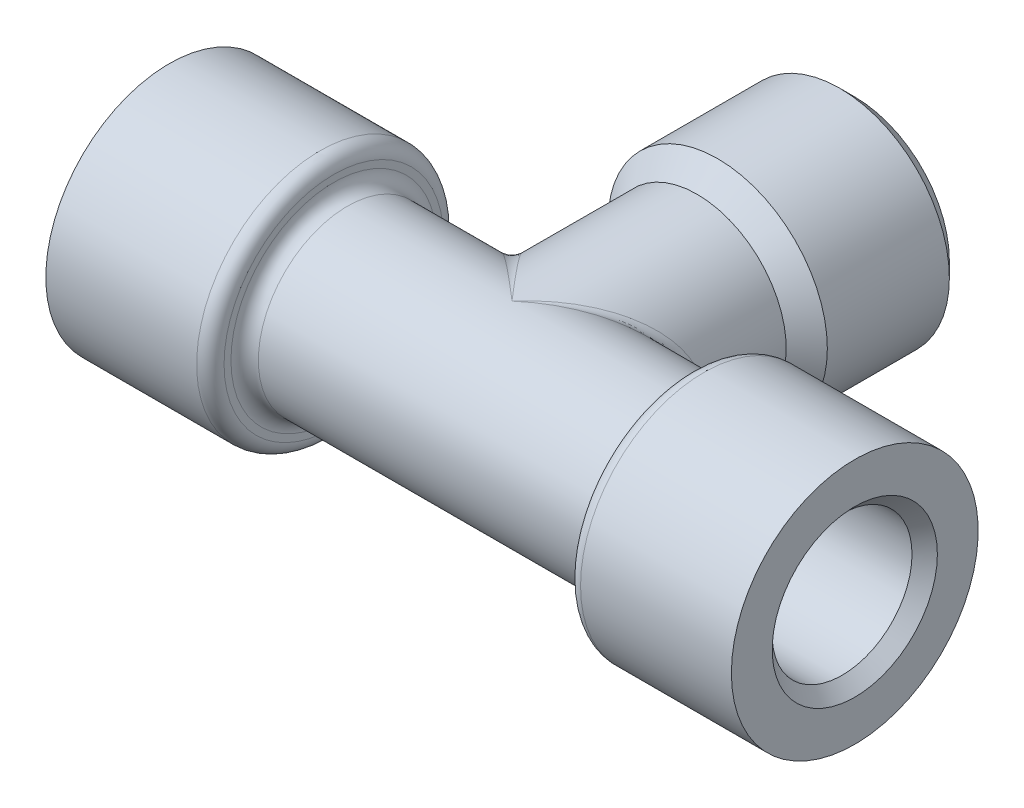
ISO-10303-21;
HEADER;
FILE_DESCRIPTION(('STEP AP214'),'2;1');
FILE_NAME('part.step','',(''),(''),'','','');
FILE_SCHEMA(('AUTOMOTIVE_DESIGN { 1 0 10303 214 1 1 1 1 }'));
ENDSEC;
DATA;
#1=APPLICATION_CONTEXT('core data for automotive mechanical design processes');
#2=APPLICATION_PROTOCOL_DEFINITION('international standard','automotive_design',2000,#1);
#3=PRODUCT_CONTEXT('',#1,'mechanical');
#4=PRODUCT('Part','Part','',(#3));
#5=PRODUCT_RELATED_PRODUCT_CATEGORY('part','',(#4));
#6=PRODUCT_DEFINITION_FORMATION('','',#4);
#7=PRODUCT_DEFINITION_CONTEXT('part definition',#1,'design');
#8=PRODUCT_DEFINITION('design','',#6,#7);
#9=PRODUCT_DEFINITION_SHAPE('','',#8);
#10=(LENGTH_UNIT() NAMED_UNIT(*) SI_UNIT(.MILLI.,.METRE.));
#11=(NAMED_UNIT(*) PLANE_ANGLE_UNIT() SI_UNIT($,.RADIAN.));
#12=(NAMED_UNIT(*) SI_UNIT($,.STERADIAN.) SOLID_ANGLE_UNIT());
#13=UNCERTAINTY_MEASURE_WITH_UNIT(LENGTH_MEASURE(1.E-05),#10,'distance_accuracy_value','');
#14=(GEOMETRIC_REPRESENTATION_CONTEXT(3) GLOBAL_UNCERTAINTY_ASSIGNED_CONTEXT((#13)) GLOBAL_UNIT_ASSIGNED_CONTEXT((#10,
#11,#12)) REPRESENTATION_CONTEXT('',''));
#15=CARTESIAN_POINT('',(0.,0.,0.));
#16=DIRECTION('',(0.,0.,1.));
#17=DIRECTION('',(1.,0.,0.));
#18=AXIS2_PLACEMENT_3D('',#15,#16,#17);
#19=CARTESIAN_POINT('',(0.,9.,-25.));
#20=DIRECTION('',(0.,0.,-1.));
#21=DIRECTION('',(-1.,0.,0.));
#22=AXIS2_PLACEMENT_3D('',#19,#20,#21);
#23=PLANE('',#22);
#24=CARTESIAN_POINT('',(0.,0.,-25.));
#25=DIRECTION('',(0.,0.,-1.));
#26=DIRECTION('',(-1.,0.,0.));
#27=AXIS2_PLACEMENT_3D('',#24,#25,#26);
#28=CIRCLE('',#27,4.);
#29=CARTESIAN_POINT('',(-3.99999999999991,0.,-25.));
#30=VERTEX_POINT('',#29);
#31=EDGE_CURVE('E75',#30,#30,#28,.T.);
#32=ORIENTED_EDGE('',*,*,#31,.F.);
#33=EDGE_LOOP('',(#32));
#34=FACE_BOUND('',#33,.T.);
#35=CARTESIAN_POINT('',(0.,0.,-25.));
#36=DIRECTION('',(0.,0.,1.));
#37=DIRECTION('',(1.,0.,0.));
#38=AXIS2_PLACEMENT_3D('',#35,#36,#37);
#39=CIRCLE('',#38,6.8985);
#40=CARTESIAN_POINT('',(6.89850000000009,0.,-25.));
#41=VERTEX_POINT('',#40);
#42=EDGE_CURVE('E175',#41,#41,#39,.T.);
#43=ORIENTED_EDGE('',*,*,#42,.F.);
#44=EDGE_LOOP('',(#43));
#45=FACE_BOUND('',#44,.T.);
#46=ADVANCED_FACE('F42',(#34,#45),#23,.T.);
#47=CARTESIAN_POINT('',(0.,0.,0.));
#48=DIRECTION('',(1.,0.,0.));
#49=DIRECTION('',(0.,0.,-1.));
#50=AXIS2_PLACEMENT_3D('',#47,#48,#49);
#51=CYLINDRICAL_SURFACE('',#50,6.5);
#52=CARTESIAN_POINT('',(12.,0.,0.));
#53=DIRECTION('',(-1.,0.,0.));
#54=DIRECTION('',(0.,0.,1.));
#55=AXIS2_PLACEMENT_3D('',#52,#53,#54);
#56=CIRCLE('',#55,6.5);
#57=CARTESIAN_POINT('',(12.,0.,6.5));
#58=VERTEX_POINT('',#57);
#59=EDGE_CURVE('E115',#58,#58,#56,.T.);
#60=ORIENTED_EDGE('',*,*,#59,.T.);
#61=EDGE_LOOP('',(#60));
#62=FACE_BOUND('',#61,.T.);
#63=CARTESIAN_POINT('',(-12.,0.,0.));
#64=DIRECTION('',(1.,0.,0.));
#65=DIRECTION('',(0.,0.,-1.));
#66=AXIS2_PLACEMENT_3D('',#63,#64,#65);
#67=CIRCLE('',#66,6.5);
#68=CARTESIAN_POINT('',(-12.,0.,-6.5));
#69=VERTEX_POINT('',#68);
#70=EDGE_CURVE('E112',#69,#69,#67,.T.);
#71=ORIENTED_EDGE('',*,*,#70,.T.);
#72=EDGE_LOOP('',(#71));
#73=FACE_BOUND('',#72,.T.);
#74=CARTESIAN_POINT('',(0.,0.,0.));
#75=DIRECTION('',(0.654930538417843,0.,-0.755689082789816));
#76=DIRECTION('',(0.755689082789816,0.,0.654930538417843));
#77=AXIS2_PLACEMENT_3D('',#74,#75,#76);
#78=ELLIPSE('',#77,9.92471662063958,6.5);
#79=CARTESIAN_POINT('',(0.,6.5,0.));
#80=VERTEX_POINT('',#79);
#81=CARTESIAN_POINT('',(0.,-6.5,0.));
#82=VERTEX_POINT('',#81);
#83=EDGE_CURVE('E107',#80,#82,#78,.F.);
#84=ORIENTED_EDGE('',*,*,#83,.T.);
#85=CARTESIAN_POINT('',(0.,0.,0.));
#86=DIRECTION('',(-0.654930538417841,0.,-0.755689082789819));
#87=DIRECTION('',(0.755689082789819,0.,-0.654930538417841));
#88=AXIS2_PLACEMENT_3D('',#85,#86,#87);
#89=ELLIPSE('',#88,9.92471662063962,6.5);
#90=EDGE_CURVE('E109',#82,#80,#89,.F.);
#91=ORIENTED_EDGE('',*,*,#90,.T.);
#92=EDGE_LOOP('',(#84,#91));
#93=FACE_BOUND('',#92,.T.);
#94=ADVANCED_FACE('F139',(#62,#73,#93),#51,.T.);
#95=CARTESIAN_POINT('',(-13.,6.5,0.));
#96=DIRECTION('',(1.,0.,0.));
#97=DIRECTION('',(0.,0.,-1.));
#98=AXIS2_PLACEMENT_3D('',#95,#96,#97);
#99=PLANE('',#98);
#100=CARTESIAN_POINT('',(-13.,0.,0.));
#101=DIRECTION('',(1.,0.,0.));
#102=DIRECTION('',(0.,0.,-1.));
#103=AXIS2_PLACEMENT_3D('',#100,#101,#102);
#104=CIRCLE('',#103,8.);
#105=CARTESIAN_POINT('',(-13.,0.,-8.));
#106=VERTEX_POINT('',#105);
#107=EDGE_CURVE('E92',#106,#106,#104,.T.);
#108=ORIENTED_EDGE('',*,*,#107,.T.);
#109=EDGE_LOOP('',(#108));
#110=FACE_BOUND('',#109,.T.);
#111=CARTESIAN_POINT('',(-13.,0.,0.));
#112=DIRECTION('',(1.,0.,0.));
#113=DIRECTION('',(0.,0.,-1.));
#114=AXIS2_PLACEMENT_3D('',#111,#112,#113);
#115=CIRCLE('',#114,7.5);
#116=CARTESIAN_POINT('',(-13.,0.,-7.5));
#117=VERTEX_POINT('',#116);
#118=EDGE_CURVE('E89',#117,#117,#115,.F.);
#119=ORIENTED_EDGE('',*,*,#118,.T.);
#120=EDGE_LOOP('',(#119));
#121=FACE_BOUND('',#120,.T.);
#122=ADVANCED_FACE('F158',(#110,#121),#99,.T.);
#123=CARTESIAN_POINT('',(0.,0.,0.));
#124=DIRECTION('',(1.,0.,0.));
#125=DIRECTION('',(0.,0.,-1.));
#126=AXIS2_PLACEMENT_3D('',#123,#124,#125);
#127=CYLINDRICAL_SURFACE('',#126,9.);
#128=CARTESIAN_POINT('',(-14.,0.,0.));
#129=DIRECTION('',(1.,0.,0.));
#130=DIRECTION('',(0.,0.,-1.));
#131=AXIS2_PLACEMENT_3D('',#128,#129,#130);
#132=CIRCLE('',#131,9.);
#133=CARTESIAN_POINT('',(-14.,0.,-9.));
#134=VERTEX_POINT('',#133);
#135=EDGE_CURVE('E95',#134,#134,#132,.F.);
#136=ORIENTED_EDGE('',*,*,#135,.T.);
#137=EDGE_LOOP('',(#136));
#138=FACE_BOUND('',#137,.T.);
#139=CARTESIAN_POINT('',(-25.,0.,0.));
#140=DIRECTION('',(1.,0.,0.));
#141=DIRECTION('',(0.,0.,-1.));
#142=AXIS2_PLACEMENT_3D('',#139,#140,#141);
#143=CIRCLE('',#142,9.);
#144=CARTESIAN_POINT('',(-25.,0.,-9.));
#145=VERTEX_POINT('',#144);
#146=EDGE_CURVE('E86',#145,#145,#143,.T.);
#147=ORIENTED_EDGE('',*,*,#146,.T.);
#148=EDGE_LOOP('',(#147));
#149=FACE_BOUND('',#148,.T.);
#150=ADVANCED_FACE('F155',(#138,#149),#127,.T.);
#151=CARTESIAN_POINT('',(-25.,9.,0.));
#152=DIRECTION('',(-1.,0.,0.));
#153=DIRECTION('',(0.,0.,1.));
#154=AXIS2_PLACEMENT_3D('',#151,#152,#153);
#155=PLANE('',#154);
#156=CARTESIAN_POINT('',(-25.,0.,0.));
#157=DIRECTION('',(-1.,0.,0.));
#158=DIRECTION('',(0.,0.,1.));
#159=AXIS2_PLACEMENT_3D('',#156,#157,#158);
#160=CIRCLE('',#159,6.025);
#161=CARTESIAN_POINT('',(-25.,0.,6.025));
#162=VERTEX_POINT('',#161);
#163=EDGE_CURVE('E181',#162,#162,#160,.T.);
#164=ORIENTED_EDGE('',*,*,#163,.F.);
#165=EDGE_LOOP('',(#164));
#166=FACE_BOUND('',#165,.T.);
#167=ORIENTED_EDGE('',*,*,#146,.F.);
#168=EDGE_LOOP('',(#167));
#169=FACE_BOUND('',#168,.T.);
#170=ADVANCED_FACE('F149',(#166,#169),#155,.T.);
#171=CARTESIAN_POINT('',(0.,0.,0.));
#172=DIRECTION('',(0.,0.,1.));
#173=DIRECTION('',(1.,0.,0.));
#174=AXIS2_PLACEMENT_3D('',#171,#172,#173);
#175=CYLINDRICAL_SURFACE('',#174,6.5);
#176=CARTESIAN_POINT('',(0.,0.,-13.5));
#177=DIRECTION('',(0.,0.,-1.));
#178=DIRECTION('',(-1.,0.,0.));
#179=AXIS2_PLACEMENT_3D('',#176,#177,#178);
#180=CIRCLE('',#179,6.5);
#181=CARTESIAN_POINT('',(-6.49999999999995,0.,-13.5000000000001));
#182=VERTEX_POINT('',#181);
#183=EDGE_CURVE('E11',#182,#182,#180,.F.);
#184=ORIENTED_EDGE('',*,*,#183,.T.);
#185=EDGE_LOOP('',(#184));
#186=FACE_BOUND('',#185,.T.);
#187=CARTESIAN_POINT('',(0.,0.,0.));
#188=DIRECTION('',(0.755689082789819,0.,-0.654930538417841));
#189=DIRECTION('',(0.654930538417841,0.,0.755689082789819));
#190=AXIS2_PLACEMENT_3D('',#187,#188,#189);
#191=ELLIPSE('',#190,9.92471662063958,6.5);
#192=EDGE_CURVE('E118',#82,#80,#191,.T.);
#193=ORIENTED_EDGE('',*,*,#192,.T.);
#194=CARTESIAN_POINT('',(0.,0.,0.));
#195=DIRECTION('',(-0.755689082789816,0.,-0.654930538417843));
#196=DIRECTION('',(0.654930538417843,0.,-0.755689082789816));
#197=AXIS2_PLACEMENT_3D('',#194,#195,#196);
#198=ELLIPSE('',#197,9.92471662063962,6.5);
#199=EDGE_CURVE('E51',#80,#82,#198,.T.);
#200=ORIENTED_EDGE('',*,*,#199,.T.);
#201=EDGE_LOOP('',(#193,#200));
#202=FACE_BOUND('',#201,.T.);
#203=ADVANCED_FACE('F143',(#186,#202),#175,.T.);
#204=CARTESIAN_POINT('',(13.,6.5,0.));
#205=DIRECTION('',(-1.,0.,0.));
#206=DIRECTION('',(0.,0.,1.));
#207=AXIS2_PLACEMENT_3D('',#204,#205,#206);
#208=PLANE('',#207);
#209=CARTESIAN_POINT('',(13.,0.,0.));
#210=DIRECTION('',(-1.,0.,0.));
#211=DIRECTION('',(0.,0.,1.));
#212=AXIS2_PLACEMENT_3D('',#209,#210,#211);
#213=CIRCLE('',#212,8.);
#214=CARTESIAN_POINT('',(13.,0.,8.));
#215=VERTEX_POINT('',#214);
#216=EDGE_CURVE('E101',#215,#215,#213,.T.);
#217=ORIENTED_EDGE('',*,*,#216,.T.);
#218=EDGE_LOOP('',(#217));
#219=FACE_BOUND('',#218,.T.);
#220=CARTESIAN_POINT('',(13.,0.,0.));
#221=DIRECTION('',(-1.,0.,0.));
#222=DIRECTION('',(0.,0.,1.));
#223=AXIS2_PLACEMENT_3D('',#220,#221,#222);
#224=CIRCLE('',#223,7.5);
#225=CARTESIAN_POINT('',(13.,0.,7.5));
#226=VERTEX_POINT('',#225);
#227=EDGE_CURVE('E98',#226,#226,#224,.F.);
#228=ORIENTED_EDGE('',*,*,#227,.T.);
#229=EDGE_LOOP('',(#228));
#230=FACE_BOUND('',#229,.T.);
#231=ADVANCED_FACE('F148',(#219,#230),#208,.T.);
#232=CARTESIAN_POINT('',(0.,0.,0.));
#233=DIRECTION('',(-1.,0.,0.));
#234=DIRECTION('',(0.,0.,1.));
#235=AXIS2_PLACEMENT_3D('',#232,#233,#234);
#236=CYLINDRICAL_SURFACE('',#235,9.);
#237=CARTESIAN_POINT('',(14.,0.,0.));
#238=DIRECTION('',(-1.,0.,0.));
#239=DIRECTION('',(0.,0.,1.));
#240=AXIS2_PLACEMENT_3D('',#237,#238,#239);
#241=CIRCLE('',#240,9.);
#242=CARTESIAN_POINT('',(14.,0.,9.));
#243=VERTEX_POINT('',#242);
#244=EDGE_CURVE('E104',#243,#243,#241,.F.);
#245=ORIENTED_EDGE('',*,*,#244,.T.);
#246=EDGE_LOOP('',(#245));
#247=FACE_BOUND('',#246,.T.);
#248=CARTESIAN_POINT('',(25.,0.,0.));
#249=DIRECTION('',(-1.,0.,0.));
#250=DIRECTION('',(0.,0.,1.));
#251=AXIS2_PLACEMENT_3D('',#248,#249,#250);
#252=CIRCLE('',#251,9.);
#253=CARTESIAN_POINT('',(25.,0.,9.));
#254=VERTEX_POINT('',#253);
#255=EDGE_CURVE('E78',#254,#254,#252,.T.);
#256=ORIENTED_EDGE('',*,*,#255,.T.);
#257=EDGE_LOOP('',(#256));
#258=FACE_BOUND('',#257,.T.);
#259=ADVANCED_FACE('F244',(#247,#258),#236,.T.);
#260=CARTESIAN_POINT('',(25.,9.,0.));
#261=DIRECTION('',(1.,0.,0.));
#262=DIRECTION('',(0.,0.,-1.));
#263=AXIS2_PLACEMENT_3D('',#260,#261,#262);
#264=PLANE('',#263);
#265=CARTESIAN_POINT('',(25.,0.,0.));
#266=DIRECTION('',(1.,0.,0.));
#267=DIRECTION('',(0.,0.,-1.));
#268=AXIS2_PLACEMENT_3D('',#265,#266,#267);
#269=CIRCLE('',#268,6.025);
#270=CARTESIAN_POINT('',(25.,0.,-6.025));
#271=VERTEX_POINT('',#270);
#272=EDGE_CURVE('E195',#271,#271,#269,.T.);
#273=ORIENTED_EDGE('',*,*,#272,.F.);
#274=EDGE_LOOP('',(#273));
#275=FACE_BOUND('',#274,.T.);
#276=ORIENTED_EDGE('',*,*,#255,.F.);
#277=EDGE_LOOP('',(#276));
#278=FACE_BOUND('',#277,.T.);
#279=ADVANCED_FACE('F240',(#275,#278),#264,.T.);
#280=CARTESIAN_POINT('',(-14.,0.,0.));
#281=DIRECTION('',(1.,0.,0.));
#282=DIRECTION('',(0.,0.,-1.));
#283=AXIS2_PLACEMENT_3D('',#280,#281,#282);
#284=TOROIDAL_SURFACE('',#283,8.,1.);
#285=ORIENTED_EDGE('',*,*,#135,.F.);
#286=EDGE_LOOP('',(#285));
#287=FACE_BOUND('',#286,.T.);
#288=ORIENTED_EDGE('',*,*,#107,.F.);
#289=EDGE_LOOP('',(#288));
#290=FACE_BOUND('',#289,.T.);
#291=ADVANCED_FACE('F243',(#287,#290),#284,.T.);
#292=CARTESIAN_POINT('',(14.,0.,0.));
#293=DIRECTION('',(-1.,0.,0.));
#294=DIRECTION('',(0.,0.,1.));
#295=AXIS2_PLACEMENT_3D('',#292,#293,#294);
#296=TOROIDAL_SURFACE('',#295,8.,1.);
#297=ORIENTED_EDGE('',*,*,#244,.F.);
#298=EDGE_LOOP('',(#297));
#299=FACE_BOUND('',#298,.T.);
#300=ORIENTED_EDGE('',*,*,#216,.F.);
#301=EDGE_LOOP('',(#300));
#302=FACE_BOUND('',#301,.T.);
#303=ADVANCED_FACE('F259',(#299,#302),#296,.T.);
#304=CARTESIAN_POINT('',(12.,0.,0.));
#305=DIRECTION('',(-1.,0.,0.));
#306=DIRECTION('',(0.,0.,1.));
#307=AXIS2_PLACEMENT_3D('',#304,#305,#306);
#308=TOROIDAL_SURFACE('',#307,7.5,1.);
#309=ORIENTED_EDGE('',*,*,#227,.F.);
#310=EDGE_LOOP('',(#309));
#311=FACE_BOUND('',#310,.T.);
#312=ORIENTED_EDGE('',*,*,#59,.F.);
#313=EDGE_LOOP('',(#312));
#314=FACE_BOUND('',#313,.T.);
#315=ADVANCED_FACE('F256',(#311,#314),#308,.F.);
#316=CARTESIAN_POINT('',(-12.,0.,0.));
#317=DIRECTION('',(1.,0.,0.));
#318=DIRECTION('',(0.,0.,-1.));
#319=AXIS2_PLACEMENT_3D('',#316,#317,#318);
#320=TOROIDAL_SURFACE('',#319,7.5,1.);
#321=ORIENTED_EDGE('',*,*,#118,.F.);
#322=EDGE_LOOP('',(#321));
#323=FACE_BOUND('',#322,.T.);
#324=ORIENTED_EDGE('',*,*,#70,.F.);
#325=EDGE_LOOP('',(#324));
#326=FACE_BOUND('',#325,.T.);
#327=ADVANCED_FACE('F134',(#323,#326),#320,.F.);
#328=CARTESIAN_POINT('',(0.,-6.5,0.));
#329=CARTESIAN_POINT('',(0.,-6.5,0.));
#330=CARTESIAN_POINT('',(0.,-6.5,0.));
#331=CARTESIAN_POINT('',(0.163400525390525,-6.49999184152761,-0.141613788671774));
#332=CARTESIAN_POINT('',(0.152507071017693,-6.50001104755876,-0.152507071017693));
#333=CARTESIAN_POINT('',(0.141613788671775,-6.49999184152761,-0.163400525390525));
#334=CARTESIAN_POINT('',(0.326777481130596,-6.49537217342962,-0.283207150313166));
#335=CARTESIAN_POINT('',(0.305100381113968,-6.49465557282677,-0.305100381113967));
#336=CARTESIAN_POINT('',(0.283207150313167,-6.49537217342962,-0.326777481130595));
#337=CARTESIAN_POINT('',(0.653194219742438,-6.4768548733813,-0.5661016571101));
#338=CARTESIAN_POINT('',(0.609617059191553,-6.47328806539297,-0.609617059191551));
#339=CARTESIAN_POINT('',(0.566101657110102,-6.4768548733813,-0.653194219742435));
#340=CARTESIAN_POINT('',(0.816233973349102,-6.46295646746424,-0.707402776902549));
#341=CARTESIAN_POINT('',(0.76175652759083,-6.45724469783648,-0.761756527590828));
#342=CARTESIAN_POINT('',(0.707402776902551,-6.46295646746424,-0.816233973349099));
#343=CARTESIAN_POINT('',(1.30150506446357,-6.40758889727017,-1.12797105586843));
#344=CARTESIAN_POINT('',(1.21447012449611,-6.39332621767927,-1.2144701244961));
#345=CARTESIAN_POINT('',(1.12797105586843,-6.40758889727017,-1.30150506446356));
#346=CARTESIAN_POINT('',(1.622777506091,-6.35244771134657,-1.40640717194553));
#347=CARTESIAN_POINT('',(1.51403405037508,-6.32945791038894,-1.51403405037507));
#348=CARTESIAN_POINT('',(1.40640717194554,-6.35244771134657,-1.622777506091));
#349=CARTESIAN_POINT('',(2.2541682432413,-6.20582805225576,-1.95361247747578));
#350=CARTESIAN_POINT('',(2.09881319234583,-6.16110583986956,-2.09881319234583));
#351=CARTESIAN_POINT('',(1.95361247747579,-6.20582805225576,-2.25416824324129));
#352=CARTESIAN_POINT('',(2.56438324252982,-6.11497457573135,-2.22246547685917));
#353=CARTESIAN_POINT('',(2.38573618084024,-6.05638189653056,-2.38573618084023));
#354=CARTESIAN_POINT('',(2.22246547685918,-6.11497457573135,-2.56438324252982));
#355=CARTESIAN_POINT('',(3.16833646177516,-5.89816315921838,-2.74589160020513));
#356=CARTESIAN_POINT('',(2.93929436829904,-5.80909169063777,-2.93929436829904));
#357=CARTESIAN_POINT('',(2.74589160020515,-5.89816315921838,-3.16833646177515));
#358=CARTESIAN_POINT('',(3.46229232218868,-5.7731251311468,-3.00065334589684));
#359=CARTESIAN_POINT('',(3.20758116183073,-5.66617507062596,-3.20758116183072));
#360=CARTESIAN_POINT('',(3.00065334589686,-5.7731251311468,-3.46229232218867));
#361=CARTESIAN_POINT('',(4.02854992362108,-5.48978737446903,-3.49140993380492));
#362=CARTESIAN_POINT('',(3.7182383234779,-5.34644239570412,-3.71823832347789));
#363=CARTESIAN_POINT('',(3.49140993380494,-5.48978737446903,-4.02854992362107));
#364=CARTESIAN_POINT('',(4.3012430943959,-5.33267305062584,-3.7277440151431));
#365=CARTESIAN_POINT('',(3.96215720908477,-5.16919195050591,-3.96215720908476));
#366=CARTESIAN_POINT('',(3.72774401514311,-5.33267305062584,-4.30124309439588));
#367=CARTESIAN_POINT('',(4.82013028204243,-4.98760253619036,-4.17744624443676));
#368=CARTESIAN_POINT('',(4.4191020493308,-4.78599293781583,-4.41910204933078));
#369=CARTESIAN_POINT('',(4.17744624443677,-4.98760253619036,-4.82013028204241));
#370=CARTESIAN_POINT('',(5.06693746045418,-4.80104493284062,-4.39134579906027));
#371=CARTESIAN_POINT('',(4.63350626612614,-4.57958418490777,-4.63350626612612));
#372=CARTESIAN_POINT('',(4.39134579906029,-4.80104493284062,-5.06693746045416));
#373=CARTESIAN_POINT('',(5.52959467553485,-4.40007030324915,-4.79231538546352));
#374=CARTESIAN_POINT('',(5.02743788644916,-4.14454522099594,-5.02743788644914));
#375=CARTESIAN_POINT('',(4.79231538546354,-4.40007030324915,-5.52959467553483));
#376=CARTESIAN_POINT('',(5.74631561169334,-4.18717873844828,-4.98014019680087));
#377=CARTESIAN_POINT('',(5.20809186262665,-3.91553743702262,-5.20809186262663));
#378=CARTESIAN_POINT('',(4.9801401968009,-4.18717873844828,-5.74631561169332));
#379=CARTESIAN_POINT('',(6.14482253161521,-3.737068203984,-5.32551286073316));
#380=CARTESIAN_POINT('',(5.53205846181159,-3.4428461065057,-5.53205846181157));
#381=CARTESIAN_POINT('',(5.32551286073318,-3.737068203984,-6.14482253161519));
#382=CARTESIAN_POINT('',(6.32774092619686,-3.50137281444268,-5.48404213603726));
#383=CARTESIAN_POINT('',(5.67616757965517,-3.19903898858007,-5.67616757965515));
#384=CARTESIAN_POINT('',(5.48404213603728,-3.50137281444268,-6.32774092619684));
#385=CARTESIAN_POINT('',(6.65524486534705,-3.00972884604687,-5.76787888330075));
#386=CARTESIAN_POINT('',(5.9267034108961,-2.70464998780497,-5.92670341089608));
#387=CARTESIAN_POINT('',(5.76787888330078,-3.00972884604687,-6.65524486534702));
#388=CARTESIAN_POINT('',(6.80116656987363,-2.7551344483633,-5.89434436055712));
#389=CARTESIAN_POINT('',(6.03355436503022,-2.45442362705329,-6.0335543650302));
#390=CARTESIAN_POINT('',(5.89434436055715,-2.7551344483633,-6.80116656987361));
#391=CARTESIAN_POINT('',(7.05198947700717,-2.23028992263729,-6.1117242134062));
#392=CARTESIAN_POINT('',(6.21173323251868,-1.95393910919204,-6.21173323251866));
#393=CARTESIAN_POINT('',(6.11172421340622,-2.23028992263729,-7.05198947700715));
#394=CARTESIAN_POINT('',(7.15827955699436,-1.96105087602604,-6.20384228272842));
#395=CARTESIAN_POINT('',(6.28314807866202,-1.70473827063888,-6.283148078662));
#396=CARTESIAN_POINT('',(6.20384228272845,-1.96105087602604,-7.15827955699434));
#397=CARTESIAN_POINT('',(7.32802063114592,-1.41196590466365,-6.35095121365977));
#398=CARTESIAN_POINT('',(6.39461502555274,-1.20974382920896,-6.39461502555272));
#399=CARTESIAN_POINT('',(6.3509512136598,-1.41196590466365,-7.32802063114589));
#400=CARTESIAN_POINT('',(7.39266210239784,-1.13268121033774,-6.4069738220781));
#401=CARTESIAN_POINT('',(6.43454952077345,-0.965815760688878,-6.43454952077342));
#402=CARTESIAN_POINT('',(6.40697382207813,-1.13268121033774,-7.39266210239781));
#403=CARTESIAN_POINT('',(7.47830247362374,-0.568823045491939,-6.48119547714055));
#404=CARTESIAN_POINT('',(6.48730756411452,-0.480033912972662,-6.48730756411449));
#405=CARTESIAN_POINT('',(6.48119547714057,-0.568823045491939,-7.47830247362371));
#406=CARTESIAN_POINT('',(7.50000000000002,-0.284411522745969,-6.5));
#407=CARTESIAN_POINT('',(6.50000000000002,-0.240717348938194,-6.5));
#408=CARTESIAN_POINT('',(6.50000000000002,-0.284411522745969,-7.5));
#409=CARTESIAN_POINT('',(7.50000000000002,0.284411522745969,-6.5));
#410=CARTESIAN_POINT('',(6.50000000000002,0.240717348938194,-6.5));
#411=CARTESIAN_POINT('',(6.50000000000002,0.284411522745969,-7.5));
#412=CARTESIAN_POINT('',(7.47830247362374,0.568823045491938,-6.48119547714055));
#413=CARTESIAN_POINT('',(6.48730756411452,0.480033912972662,-6.48730756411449));
#414=CARTESIAN_POINT('',(6.48119547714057,0.568823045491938,-7.47830247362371));
#415=CARTESIAN_POINT('',(7.39266210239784,1.13268121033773,-6.4069738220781));
#416=CARTESIAN_POINT('',(6.43454952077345,0.965815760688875,-6.43454952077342));
#417=CARTESIAN_POINT('',(6.40697382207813,1.13268121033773,-7.39266210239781));
#418=CARTESIAN_POINT('',(7.32802063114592,1.41196590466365,-6.35095121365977));
#419=CARTESIAN_POINT('',(6.39461502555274,1.20974382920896,-6.39461502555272));
#420=CARTESIAN_POINT('',(6.3509512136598,1.41196590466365,-7.32802063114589));
#421=CARTESIAN_POINT('',(7.15827955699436,1.96105087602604,-6.20384228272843));
#422=CARTESIAN_POINT('',(6.28314807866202,1.70473827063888,-6.283148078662));
#423=CARTESIAN_POINT('',(6.20384228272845,1.96105087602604,-7.15827955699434));
#424=CARTESIAN_POINT('',(7.05198947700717,2.23028992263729,-6.1117242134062));
#425=CARTESIAN_POINT('',(6.21173323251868,1.95393910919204,-6.21173323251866));
#426=CARTESIAN_POINT('',(6.11172421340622,2.23028992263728,-7.05198947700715));
#427=CARTESIAN_POINT('',(6.80116656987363,2.7551344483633,-5.89434436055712));
#428=CARTESIAN_POINT('',(6.03355436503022,2.45442362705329,-6.0335543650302));
#429=CARTESIAN_POINT('',(5.89434436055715,2.7551344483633,-6.80116656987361));
#430=CARTESIAN_POINT('',(6.65524486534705,3.00972884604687,-5.76787888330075));
#431=CARTESIAN_POINT('',(5.9267034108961,2.70464998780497,-5.92670341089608));
#432=CARTESIAN_POINT('',(5.76787888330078,3.00972884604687,-6.65524486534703));
#433=CARTESIAN_POINT('',(6.32774092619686,3.50137281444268,-5.48404213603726));
#434=CARTESIAN_POINT('',(5.67616757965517,3.19903898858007,-5.67616757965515));
#435=CARTESIAN_POINT('',(5.48404213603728,3.50137281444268,-6.32774092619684));
#436=CARTESIAN_POINT('',(6.14482253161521,3.73706820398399,-5.32551286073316));
#437=CARTESIAN_POINT('',(5.53205846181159,3.4428461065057,-5.53205846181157));
#438=CARTESIAN_POINT('',(5.32551286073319,3.73706820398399,-6.14482253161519));
#439=CARTESIAN_POINT('',(5.74631561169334,4.18717873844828,-4.98014019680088));
#440=CARTESIAN_POINT('',(5.20809186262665,3.91553743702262,-5.20809186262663));
#441=CARTESIAN_POINT('',(4.9801401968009,4.18717873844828,-5.74631561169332));
#442=CARTESIAN_POINT('',(5.52959467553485,4.40007030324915,-4.79231538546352));
#443=CARTESIAN_POINT('',(5.02743788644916,4.14454522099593,-5.02743788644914));
#444=CARTESIAN_POINT('',(4.79231538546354,4.40007030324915,-5.52959467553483));
#445=CARTESIAN_POINT('',(5.06693746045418,4.80104493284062,-4.39134579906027));
#446=CARTESIAN_POINT('',(4.63350626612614,4.57958418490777,-4.63350626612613));
#447=CARTESIAN_POINT('',(4.39134579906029,4.80104493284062,-5.06693746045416));
#448=CARTESIAN_POINT('',(4.82013028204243,4.98760253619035,-4.17744624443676));
#449=CARTESIAN_POINT('',(4.4191020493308,4.78599293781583,-4.41910204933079));
#450=CARTESIAN_POINT('',(4.17744624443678,4.98760253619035,-4.82013028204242));
#451=CARTESIAN_POINT('',(4.3012430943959,5.33267305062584,-3.7277440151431));
#452=CARTESIAN_POINT('',(3.96215720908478,5.16919195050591,-3.96215720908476));
#453=CARTESIAN_POINT('',(3.72774401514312,5.33267305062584,-4.30124309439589));
#454=CARTESIAN_POINT('',(4.02854992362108,5.48978737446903,-3.49140993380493));
#455=CARTESIAN_POINT('',(3.7182383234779,5.34644239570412,-3.71823832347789));
#456=CARTESIAN_POINT('',(3.49140993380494,5.48978737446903,-4.02854992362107));
#457=CARTESIAN_POINT('',(3.46229232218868,5.7731251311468,-3.00065334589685));
#458=CARTESIAN_POINT('',(3.20758116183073,5.66617507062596,-3.20758116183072));
#459=CARTESIAN_POINT('',(3.00065334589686,5.7731251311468,-3.46229232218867));
#460=CARTESIAN_POINT('',(3.16833646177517,5.89816315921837,-2.74589160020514));
#461=CARTESIAN_POINT('',(2.93929436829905,5.80909169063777,-2.93929436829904));
#462=CARTESIAN_POINT('',(2.74589160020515,5.89816315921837,-3.16833646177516));
#463=CARTESIAN_POINT('',(2.56438324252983,6.11497457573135,-2.22246547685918));
#464=CARTESIAN_POINT('',(2.38573618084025,6.05638189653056,-2.38573618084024));
#465=CARTESIAN_POINT('',(2.22246547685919,6.11497457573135,-2.56438324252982));
#466=CARTESIAN_POINT('',(2.2541682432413,6.20582805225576,-1.95361247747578));
#467=CARTESIAN_POINT('',(2.09881319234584,6.16110583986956,-2.09881319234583));
#468=CARTESIAN_POINT('',(1.95361247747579,6.20582805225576,-2.25416824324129));
#469=CARTESIAN_POINT('',(1.622777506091,6.35244771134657,-1.40640717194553));
#470=CARTESIAN_POINT('',(1.51403405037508,6.32945791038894,-1.51403405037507));
#471=CARTESIAN_POINT('',(1.40640717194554,6.35244771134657,-1.622777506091));
#472=CARTESIAN_POINT('',(1.30150506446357,6.40758889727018,-1.12797105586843));
#473=CARTESIAN_POINT('',(1.21447012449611,6.39332621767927,-1.21447012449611));
#474=CARTESIAN_POINT('',(1.12797105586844,6.40758889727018,-1.30150506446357));
#475=CARTESIAN_POINT('',(0.816233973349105,6.46295646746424,-0.707402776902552));
#476=CARTESIAN_POINT('',(0.761756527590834,6.45724469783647,-0.761756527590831));
#477=CARTESIAN_POINT('',(0.707402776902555,6.46295646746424,-0.816233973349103));
#478=CARTESIAN_POINT('',(0.653194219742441,6.4768548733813,-0.566101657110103));
#479=CARTESIAN_POINT('',(0.609617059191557,6.47328806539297,-0.609617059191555));
#480=CARTESIAN_POINT('',(0.566101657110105,6.4768548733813,-0.65319421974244));
#481=CARTESIAN_POINT('',(0.326777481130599,6.49537217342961,-0.283207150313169));
#482=CARTESIAN_POINT('',(0.305100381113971,6.49465557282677,-0.30510038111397));
#483=CARTESIAN_POINT('',(0.28320715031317,6.49537217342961,-0.326777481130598));
#484=CARTESIAN_POINT('',(0.163400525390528,6.49999184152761,-0.141613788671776));
#485=CARTESIAN_POINT('',(0.152507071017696,6.50001104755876,-0.152507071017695));
#486=CARTESIAN_POINT('',(0.141613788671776,6.49999184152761,-0.163400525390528));
#487=CARTESIAN_POINT('',(0.,6.5,0.));
#488=CARTESIAN_POINT('',(0.,6.5,0.));
#489=CARTESIAN_POINT('',(0.,6.5,0.));
#490=(BOUNDED_SURFACE() B_SPLINE_SURFACE(3,2,((#328,#329,#330),(#331,#332,#333),(#334,#335,
#336),(#337,#338,#339),(#340,#341,#342),(#343,#344,#345),(#346,#347,#348),(#349,#350,#351),
(#352,#353,#354),(#355,#356,#357),(#358,#359,#360),(#361,#362,#363),(#364,#365,#366),(#367,#368,
#369),(#370,#371,#372),(#373,#374,#375),(#376,#377,#378),(#379,#380,#381),(#382,#383,#384),
(#385,#386,#387),(#388,#389,#390),(#391,#392,#393),(#394,#395,#396),(#397,#398,#399),(#400,#401,
#402),(#403,#404,#405),(#406,#407,#408),(#409,#410,#411),(#412,#413,#414),(#415,#416,#417),
(#418,#419,#420),(#421,#422,#423),(#424,#425,#426),(#427,#428,#429),(#430,#431,#432),(#433,#434,
#435),(#436,#437,#438),(#439,#440,#441),(#442,#443,#444),(#445,#446,#447),(#448,#449,#450),
(#451,#452,#453),(#454,#455,#456),(#457,#458,#459),(#460,#461,#462),(#463,#464,#465),(#466,#467,
#468),(#469,#470,#471),(#472,#473,#474),(#475,#476,#477),(#478,#479,#480),(#481,#482,#483),
(#484,#485,#486),(#487,#488,#489)),.UNSPECIFIED.,.F.,.F.,.F.) B_SPLINE_SURFACE_WITH_KNOTS((4,2,
2,2,2,2,2,2,2,2,2,2,2,2,2,2,2,2,2,2,2,2,2,2,2,2,4),(3,3),(0.,0.693120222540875,1.38629826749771,
2.76044345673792,4.11154017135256,5.42935343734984,6.70522062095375,7.93261310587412,
9.1077160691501,10.2300004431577,11.3027201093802,12.333203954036,13.3327459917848,
14.3158889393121,15.2990318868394,16.2985739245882,17.3290577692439,18.4017774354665,
19.5240618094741,20.69916477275,21.9265572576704,23.2024244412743,24.5202377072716,
25.8713344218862,27.2454796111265,27.9386576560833,28.6317778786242),(0.,1.),
.UNSPECIFIED.) GEOMETRIC_REPRESENTATION_ITEM() RATIONAL_B_SPLINE_SURFACE(((1.,1.,1.),(1.,
0.999999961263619,1.),(1.,0.999643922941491,1.),(1.,0.998220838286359,1.),(1.,0.997153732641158,
1.),(1.,0.992912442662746,1.),(1.,0.988698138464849,1.),(1.,0.977616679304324,1.),(1.,
0.970795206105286,1.),(1.,0.954789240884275,1.),(1.,0.945667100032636,1.),(1.,0.925487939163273,
1.),(1.,0.914501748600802,1.),(1.,0.891170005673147,1.),(1.,0.878891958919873,1.),(1.,
0.853706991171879,1.),(1.,0.84084914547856,1.),(1.,0.815387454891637,1.),(1.,0.802798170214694,
1.),(1.,0.778880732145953,1.),(1.,0.767521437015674,1.),(1.,0.747118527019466,1.),(1.,
0.738001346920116,1.),(1.,0.723039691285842,1.),(1.,0.71710516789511,1.),(1.,0.709170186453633,
1.),(1.,0.707106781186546,1.),(1.,0.707106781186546,1.),(1.,0.709170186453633,1.),(1.,
0.71710516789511,1.),(1.,0.723039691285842,1.),(1.,0.738001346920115,1.),(1.,0.747118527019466,
1.),(1.,0.767521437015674,1.),(1.,0.778880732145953,1.),(1.,0.802798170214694,1.),(1.,
0.815387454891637,1.),(1.,0.84084914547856,1.),(1.,0.853706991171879,1.),(1.,0.878891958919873,
1.),(1.,0.891170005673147,1.),(1.,0.914501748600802,1.),(1.,0.925487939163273,1.),(1.,
0.945667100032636,1.),(1.,0.954789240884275,1.),(1.,0.970795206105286,1.),(1.,0.977616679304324,
1.),(1.,0.988698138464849,1.),(1.,0.992912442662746,1.),(1.,0.997153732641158,1.),(1.,
0.998220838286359,1.),(1.,0.999643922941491,1.),(1.,0.999999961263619,1.),(1.,1.,1.))) REPRESENTATION_ITEM('') SURFACE());
#491=ORIENTED_EDGE('',*,*,#90,.F.);
#492=ORIENTED_EDGE('',*,*,#199,.F.);
#493=EDGE_LOOP('',(#491,#492));
#494=FACE_BOUND('',#493,.T.);
#495=ADVANCED_FACE('F126',(#494),#490,.F.);
#496=CARTESIAN_POINT('',(0.,6.5,0.));
#497=CARTESIAN_POINT('',(0.,6.5,0.));
#498=CARTESIAN_POINT('',(0.,6.5,0.));
#499=CARTESIAN_POINT('',(-0.163400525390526,6.49999184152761,-0.141613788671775));
#500=CARTESIAN_POINT('',(-0.152507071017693,6.50001104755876,-0.152507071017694));
#501=CARTESIAN_POINT('',(-0.141613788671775,6.49999184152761,-0.163400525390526));
#502=CARTESIAN_POINT('',(-0.326777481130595,6.49537217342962,-0.283207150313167));
#503=CARTESIAN_POINT('',(-0.305100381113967,6.49465557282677,-0.305100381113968));
#504=CARTESIAN_POINT('',(-0.283207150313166,6.49537217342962,-0.326777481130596));
#505=CARTESIAN_POINT('',(-0.653194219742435,6.4768548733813,-0.566101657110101));
#506=CARTESIAN_POINT('',(-0.60961705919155,6.47328806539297,-0.609617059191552));
#507=CARTESIAN_POINT('',(-0.566101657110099,6.4768548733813,-0.653194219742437));
#508=CARTESIAN_POINT('',(-0.816233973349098,6.46295646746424,-0.70740277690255));
#509=CARTESIAN_POINT('',(-0.761756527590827,6.45724469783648,-0.761756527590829));
#510=CARTESIAN_POINT('',(-0.707402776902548,6.46295646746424,-0.816233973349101));
#511=CARTESIAN_POINT('',(-1.30150506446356,6.40758889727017,-1.12797105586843));
#512=CARTESIAN_POINT('',(-1.2144701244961,6.39332621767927,-1.21447012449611));
#513=CARTESIAN_POINT('',(-1.12797105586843,6.40758889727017,-1.30150506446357));
#514=CARTESIAN_POINT('',(-1.62277750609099,6.35244771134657,-1.40640717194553));
#515=CARTESIAN_POINT('',(-1.51403405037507,6.32945791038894,-1.51403405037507));
#516=CARTESIAN_POINT('',(-1.40640717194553,6.35244771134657,-1.622777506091));
#517=CARTESIAN_POINT('',(-2.25416824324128,6.20582805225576,-1.95361247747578));
#518=CARTESIAN_POINT('',(-2.09881319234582,6.16110583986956,-2.09881319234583));
#519=CARTESIAN_POINT('',(-1.95361247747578,6.20582805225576,-2.25416824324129));
#520=CARTESIAN_POINT('',(-2.56438324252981,6.11497457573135,-2.22246547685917));
#521=CARTESIAN_POINT('',(-2.38573618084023,6.05638189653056,-2.38573618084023));
#522=CARTESIAN_POINT('',(-2.22246547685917,6.11497457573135,-2.56438324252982));
#523=CARTESIAN_POINT('',(-3.16833646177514,5.89816315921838,-2.74589160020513));
#524=CARTESIAN_POINT('',(-2.93929436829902,5.80909169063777,-2.93929436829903));
#525=CARTESIAN_POINT('',(-2.74589160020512,5.89816315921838,-3.16833646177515));
#526=CARTESIAN_POINT('',(-3.46229232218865,5.7731251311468,-3.00065334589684));
#527=CARTESIAN_POINT('',(-3.2075811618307,5.66617507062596,-3.20758116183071));
#528=CARTESIAN_POINT('',(-3.00065334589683,5.7731251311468,-3.46229232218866));
#529=CARTESIAN_POINT('',(-4.02854992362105,5.48978737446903,-3.49140993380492));
#530=CARTESIAN_POINT('',(-3.71823832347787,5.34644239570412,-3.71823832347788));
#531=CARTESIAN_POINT('',(-3.49140993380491,5.48978737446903,-4.02854992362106));
#532=CARTESIAN_POINT('',(-4.30124309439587,5.33267305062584,-3.7277440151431));
#533=CARTESIAN_POINT('',(-3.96215720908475,5.16919195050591,-3.96215720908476));
#534=CARTESIAN_POINT('',(-3.72774401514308,5.33267305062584,-4.30124309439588));
#535=CARTESIAN_POINT('',(-4.8201302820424,4.98760253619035,-4.17744624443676));
#536=CARTESIAN_POINT('',(-4.41910204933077,4.78599293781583,-4.41910204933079));
#537=CARTESIAN_POINT('',(-4.17744624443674,4.98760253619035,-4.82013028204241));
#538=CARTESIAN_POINT('',(-5.06693746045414,4.80104493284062,-4.39134579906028));
#539=CARTESIAN_POINT('',(-4.63350626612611,4.57958418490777,-4.63350626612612));
#540=CARTESIAN_POINT('',(-4.39134579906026,4.80104493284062,-5.06693746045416));
#541=CARTESIAN_POINT('',(-5.52959467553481,4.40007030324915,-4.79231538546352));
#542=CARTESIAN_POINT('',(-5.02743788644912,4.14454522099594,-5.02743788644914));
#543=CARTESIAN_POINT('',(-4.7923153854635,4.40007030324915,-5.52959467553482));
#544=CARTESIAN_POINT('',(-5.7463156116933,4.18717873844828,-4.98014019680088));
#545=CARTESIAN_POINT('',(-5.20809186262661,3.91553743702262,-5.20809186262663));
#546=CARTESIAN_POINT('',(-4.98014019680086,4.18717873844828,-5.74631561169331));
#547=CARTESIAN_POINT('',(-6.14482253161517,3.73706820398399,-5.32551286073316));
#548=CARTESIAN_POINT('',(-5.53205846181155,3.4428461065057,-5.53205846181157));
#549=CARTESIAN_POINT('',(-5.32551286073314,3.73706820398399,-6.14482253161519));
#550=CARTESIAN_POINT('',(-6.32774092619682,3.50137281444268,-5.48404213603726));
#551=CARTESIAN_POINT('',(-5.67616757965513,3.19903898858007,-5.67616757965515));
#552=CARTESIAN_POINT('',(-5.48404213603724,3.50137281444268,-6.32774092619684));
#553=CARTESIAN_POINT('',(-6.655244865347,3.00972884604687,-5.76787888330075));
#554=CARTESIAN_POINT('',(-5.92670341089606,2.70464998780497,-5.92670341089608));
#555=CARTESIAN_POINT('',(-5.76787888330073,3.00972884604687,-6.65524486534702));
#556=CARTESIAN_POINT('',(-6.80116656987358,2.7551344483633,-5.89434436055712));
#557=CARTESIAN_POINT('',(-6.03355436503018,2.4544236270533,-6.0335543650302));
#558=CARTESIAN_POINT('',(-5.8943443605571,2.7551344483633,-6.8011665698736));
#559=CARTESIAN_POINT('',(-7.05198947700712,2.23028992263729,-6.1117242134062));
#560=CARTESIAN_POINT('',(-6.21173323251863,1.95393910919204,-6.21173323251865));
#561=CARTESIAN_POINT('',(-6.11172421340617,2.23028992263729,-7.05198947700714));
#562=CARTESIAN_POINT('',(-7.15827955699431,1.96105087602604,-6.20384228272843));
#563=CARTESIAN_POINT('',(-6.28314807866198,1.70473827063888,-6.283148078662));
#564=CARTESIAN_POINT('',(-6.2038422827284,1.96105087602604,-7.15827955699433));
#565=CARTESIAN_POINT('',(-7.32802063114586,1.41196590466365,-6.35095121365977));
#566=CARTESIAN_POINT('',(-6.39461502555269,1.20974382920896,-6.39461502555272));
#567=CARTESIAN_POINT('',(-6.35095121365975,1.41196590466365,-7.32802063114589));
#568=CARTESIAN_POINT('',(-7.39266210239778,1.13268121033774,-6.4069738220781));
#569=CARTESIAN_POINT('',(-6.4345495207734,0.96581576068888,-6.43454952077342));
#570=CARTESIAN_POINT('',(-6.40697382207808,1.13268121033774,-7.39266210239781));
#571=CARTESIAN_POINT('',(-7.47830247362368,0.56882304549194,-6.48119547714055));
#572=CARTESIAN_POINT('',(-6.48730756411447,0.480033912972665,-6.48730756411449));
#573=CARTESIAN_POINT('',(-6.48119547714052,0.56882304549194,-7.47830247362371));
#574=CARTESIAN_POINT('',(-7.49999999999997,0.284411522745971,-6.5));
#575=CARTESIAN_POINT('',(-6.49999999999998,0.240717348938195,-6.5));
#576=CARTESIAN_POINT('',(-6.49999999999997,0.284411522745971,-7.49999999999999));
#577=CARTESIAN_POINT('',(-7.49999999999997,-0.284411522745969,-6.5));
#578=CARTESIAN_POINT('',(-6.49999999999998,-0.240717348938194,-6.5));
#579=CARTESIAN_POINT('',(-6.49999999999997,-0.284411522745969,-7.49999999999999));
#580=CARTESIAN_POINT('',(-7.47830247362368,-0.568823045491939,-6.48119547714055));
#581=CARTESIAN_POINT('',(-6.48730756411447,-0.480033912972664,-6.48730756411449));
#582=CARTESIAN_POINT('',(-6.48119547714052,-0.568823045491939,-7.47830247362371));
#583=CARTESIAN_POINT('',(-7.39266210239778,-1.13268121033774,-6.4069738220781));
#584=CARTESIAN_POINT('',(-6.4345495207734,-0.965815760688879,-6.43454952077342));
#585=CARTESIAN_POINT('',(-6.40697382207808,-1.13268121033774,-7.39266210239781));
#586=CARTESIAN_POINT('',(-7.32802063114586,-1.41196590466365,-6.35095121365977));
#587=CARTESIAN_POINT('',(-6.3946150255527,-1.20974382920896,-6.39461502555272));
#588=CARTESIAN_POINT('',(-6.35095121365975,-1.41196590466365,-7.32802063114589));
#589=CARTESIAN_POINT('',(-7.15827955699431,-1.96105087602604,-6.20384228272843));
#590=CARTESIAN_POINT('',(-6.28314807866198,-1.70473827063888,-6.283148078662));
#591=CARTESIAN_POINT('',(-6.2038422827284,-1.96105087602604,-7.15827955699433));
#592=CARTESIAN_POINT('',(-7.05198947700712,-2.23028992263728,-6.1117242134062));
#593=CARTESIAN_POINT('',(-6.21173323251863,-1.95393910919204,-6.21173323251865));
#594=CARTESIAN_POINT('',(-6.11172421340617,-2.23028992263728,-7.05198947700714));
#595=CARTESIAN_POINT('',(-6.80116656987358,-2.7551344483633,-5.89434436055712));
#596=CARTESIAN_POINT('',(-6.03355436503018,-2.45442362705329,-6.0335543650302));
#597=CARTESIAN_POINT('',(-5.8943443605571,-2.7551344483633,-6.8011665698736));
#598=CARTESIAN_POINT('',(-6.655244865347,-3.00972884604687,-5.76787888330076));
#599=CARTESIAN_POINT('',(-5.92670341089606,-2.70464998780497,-5.92670341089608));
#600=CARTESIAN_POINT('',(-5.76787888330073,-3.00972884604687,-6.65524486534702));
#601=CARTESIAN_POINT('',(-6.32774092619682,-3.50137281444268,-5.48404213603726));
#602=CARTESIAN_POINT('',(-5.67616757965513,-3.19903898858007,-5.67616757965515));
#603=CARTESIAN_POINT('',(-5.48404213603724,-3.50137281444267,-6.32774092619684));
#604=CARTESIAN_POINT('',(-6.14482253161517,-3.73706820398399,-5.32551286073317));
#605=CARTESIAN_POINT('',(-5.53205846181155,-3.4428461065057,-5.53205846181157));
#606=CARTESIAN_POINT('',(-5.32551286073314,-3.73706820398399,-6.14482253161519));
#607=CARTESIAN_POINT('',(-5.7463156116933,-4.18717873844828,-4.98014019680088));
#608=CARTESIAN_POINT('',(-5.20809186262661,-3.91553743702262,-5.20809186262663));
#609=CARTESIAN_POINT('',(-4.98014019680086,-4.18717873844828,-5.74631561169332));
#610=CARTESIAN_POINT('',(-5.52959467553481,-4.40007030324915,-4.79231538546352));
#611=CARTESIAN_POINT('',(-5.02743788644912,-4.14454522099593,-5.02743788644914));
#612=CARTESIAN_POINT('',(-4.7923153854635,-4.40007030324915,-5.52959467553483));
#613=CARTESIAN_POINT('',(-5.06693746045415,-4.80104493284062,-4.39134579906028));
#614=CARTESIAN_POINT('',(-4.63350626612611,-4.57958418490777,-4.63350626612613));
#615=CARTESIAN_POINT('',(-4.39134579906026,-4.80104493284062,-5.06693746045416));
#616=CARTESIAN_POINT('',(-4.8201302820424,-4.98760253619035,-4.17744624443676));
#617=CARTESIAN_POINT('',(-4.41910204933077,-4.78599293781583,-4.41910204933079));
#618=CARTESIAN_POINT('',(-4.17744624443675,-4.98760253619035,-4.82013028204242));
#619=CARTESIAN_POINT('',(-4.30124309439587,-5.33267305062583,-3.7277440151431));
#620=CARTESIAN_POINT('',(-3.96215720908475,-5.16919195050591,-3.96215720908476));
#621=CARTESIAN_POINT('',(-3.72774401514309,-5.33267305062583,-4.30124309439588));
#622=CARTESIAN_POINT('',(-4.02854992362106,-5.48978737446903,-3.49140993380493));
#623=CARTESIAN_POINT('',(-3.71823832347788,-5.34644239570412,-3.71823832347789));
#624=CARTESIAN_POINT('',(-3.49140993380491,-5.48978737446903,-4.02854992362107));
#625=CARTESIAN_POINT('',(-3.46229232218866,-5.7731251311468,-3.00065334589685));
#626=CARTESIAN_POINT('',(-3.20758116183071,-5.66617507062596,-3.20758116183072));
#627=CARTESIAN_POINT('',(-3.00065334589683,-5.7731251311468,-3.46229232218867));
#628=CARTESIAN_POINT('',(-3.16833646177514,-5.89816315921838,-2.74589160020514));
#629=CARTESIAN_POINT('',(-2.93929436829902,-5.80909169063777,-2.93929436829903));
#630=CARTESIAN_POINT('',(-2.74589160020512,-5.89816315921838,-3.16833646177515));
#631=CARTESIAN_POINT('',(-2.56438324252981,-6.11497457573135,-2.22246547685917));
#632=CARTESIAN_POINT('',(-2.38573618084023,-6.05638189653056,-2.38573618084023));
#633=CARTESIAN_POINT('',(-2.22246547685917,-6.11497457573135,-2.56438324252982));
#634=CARTESIAN_POINT('',(-2.25416824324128,-6.20582805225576,-1.95361247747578));
#635=CARTESIAN_POINT('',(-2.09881319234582,-6.16110583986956,-2.09881319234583));
#636=CARTESIAN_POINT('',(-1.95361247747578,-6.20582805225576,-2.25416824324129));
#637=CARTESIAN_POINT('',(-1.62277750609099,-6.35244771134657,-1.40640717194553));
#638=CARTESIAN_POINT('',(-1.51403405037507,-6.32945791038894,-1.51403405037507));
#639=CARTESIAN_POINT('',(-1.40640717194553,-6.35244771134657,-1.622777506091));
#640=CARTESIAN_POINT('',(-1.30150506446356,-6.40758889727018,-1.12797105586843));
#641=CARTESIAN_POINT('',(-1.2144701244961,-6.39332621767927,-1.21447012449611));
#642=CARTESIAN_POINT('',(-1.12797105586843,-6.40758889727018,-1.30150506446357));
#643=CARTESIAN_POINT('',(-0.816233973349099,-6.46295646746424,-0.707402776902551));
#644=CARTESIAN_POINT('',(-0.761756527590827,-6.45724469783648,-0.76175652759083));
#645=CARTESIAN_POINT('',(-0.707402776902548,-6.46295646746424,-0.816233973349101));
#646=CARTESIAN_POINT('',(-0.653194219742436,-6.4768548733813,-0.566101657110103));
#647=CARTESIAN_POINT('',(-0.609617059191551,-6.47328806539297,-0.609617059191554));
#648=CARTESIAN_POINT('',(-0.5661016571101,-6.4768548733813,-0.653194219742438));
#649=CARTESIAN_POINT('',(-0.326777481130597,-6.49537217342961,-0.283207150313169));
#650=CARTESIAN_POINT('',(-0.305100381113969,-6.49465557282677,-0.30510038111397));
#651=CARTESIAN_POINT('',(-0.283207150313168,-6.49537217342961,-0.326777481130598));
#652=CARTESIAN_POINT('',(-0.163400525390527,-6.49999184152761,-0.141613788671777));
#653=CARTESIAN_POINT('',(-0.152507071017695,-6.50001104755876,-0.152507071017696));
#654=CARTESIAN_POINT('',(-0.141613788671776,-6.49999184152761,-0.163400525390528));
#655=CARTESIAN_POINT('',(0.,-6.5,0.));
#656=CARTESIAN_POINT('',(0.,-6.5,0.));
#657=CARTESIAN_POINT('',(0.,-6.5,0.));
#658=(BOUNDED_SURFACE() B_SPLINE_SURFACE(3,2,((#496,#497,#498),(#499,#500,#501),(#502,#503,
#504),(#505,#506,#507),(#508,#509,#510),(#511,#512,#513),(#514,#515,#516),(#517,#518,#519),
(#520,#521,#522),(#523,#524,#525),(#526,#527,#528),(#529,#530,#531),(#532,#533,#534),(#535,#536,
#537),(#538,#539,#540),(#541,#542,#543),(#544,#545,#546),(#547,#548,#549),(#550,#551,#552),
(#553,#554,#555),(#556,#557,#558),(#559,#560,#561),(#562,#563,#564),(#565,#566,#567),(#568,#569,
#570),(#571,#572,#573),(#574,#575,#576),(#577,#578,#579),(#580,#581,#582),(#583,#584,#585),
(#586,#587,#588),(#589,#590,#591),(#592,#593,#594),(#595,#596,#597),(#598,#599,#600),(#601,#602,
#603),(#604,#605,#606),(#607,#608,#609),(#610,#611,#612),(#613,#614,#615),(#616,#617,#618),
(#619,#620,#621),(#622,#623,#624),(#625,#626,#627),(#628,#629,#630),(#631,#632,#633),(#634,#635,
#636),(#637,#638,#639),(#640,#641,#642),(#643,#644,#645),(#646,#647,#648),(#649,#650,#651),
(#652,#653,#654),(#655,#656,#657)),.UNSPECIFIED.,.F.,.F.,.F.) B_SPLINE_SURFACE_WITH_KNOTS((4,2,
2,2,2,2,2,2,2,2,2,2,2,2,2,2,2,2,2,2,2,2,2,2,2,2,4),(3,3),(0.,0.693120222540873,1.38629826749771,
2.76044345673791,4.11154017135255,5.42935343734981,6.70522062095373,7.9326131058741,
9.10771606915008,10.2300004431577,11.3027201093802,12.3332039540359,13.3327459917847,
14.3158889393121,15.2990318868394,16.2985739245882,17.3290577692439,18.4017774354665,
19.524061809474,20.69916477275,21.9265572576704,23.2024244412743,24.5202377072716,
25.8713344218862,27.2454796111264,27.9386576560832,28.6317778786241),(0.,1.),
.UNSPECIFIED.) GEOMETRIC_REPRESENTATION_ITEM() RATIONAL_B_SPLINE_SURFACE(((1.,1.,1.),(1.,
0.999999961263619,1.),(1.,0.999643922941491,1.),(1.,0.998220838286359,1.),(1.,0.997153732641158,
1.),(1.,0.992912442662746,1.),(1.,0.988698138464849,1.),(1.,0.977616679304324,1.),(1.,
0.970795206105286,1.),(1.,0.954789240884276,1.),(1.,0.945667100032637,1.),(1.,0.925487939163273,
1.),(1.,0.914501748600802,1.),(1.,0.891170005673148,1.),(1.,0.878891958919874,1.),(1.,
0.853706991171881,1.),(1.,0.840849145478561,1.),(1.,0.815387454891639,1.),(1.,0.802798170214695,
1.),(1.,0.778880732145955,1.),(1.,0.767521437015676,1.),(1.,0.747118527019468,1.),(1.,
0.738001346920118,1.),(1.,0.723039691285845,1.),(1.,0.717105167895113,1.),(1.,0.709170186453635,
1.),(1.,0.707106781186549,1.),(1.,0.707106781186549,1.),(1.,0.709170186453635,1.),(1.,
0.717105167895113,1.),(1.,0.723039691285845,1.),(1.,0.738001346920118,1.),(1.,0.747118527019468,
1.),(1.,0.767521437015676,1.),(1.,0.778880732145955,1.),(1.,0.802798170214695,1.),(1.,
0.815387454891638,1.),(1.,0.840849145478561,1.),(1.,0.85370699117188,1.),(1.,0.878891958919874,
1.),(1.,0.891170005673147,1.),(1.,0.914501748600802,1.),(1.,0.925487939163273,1.),(1.,
0.945667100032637,1.),(1.,0.954789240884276,1.),(1.,0.970795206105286,1.),(1.,0.977616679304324,
1.),(1.,0.988698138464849,1.),(1.,0.992912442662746,1.),(1.,0.997153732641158,1.),(1.,
0.998220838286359,1.),(1.,0.999643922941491,1.),(1.,0.999999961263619,1.),(1.,1.,1.))) REPRESENTATION_ITEM('') SURFACE());
#659=ORIENTED_EDGE('',*,*,#192,.F.);
#660=ORIENTED_EDGE('',*,*,#83,.F.);
#661=EDGE_LOOP('',(#659,#660));
#662=FACE_BOUND('',#661,.T.);
#663=ADVANCED_FACE('F133',(#662),#658,.F.);
#664=CARTESIAN_POINT('',(-25.,0.,0.));
#665=DIRECTION('',(1.,0.,0.));
#666=DIRECTION('',(0.,0.,-1.));
#667=AXIS2_PLACEMENT_3D('',#664,#665,#666);
#668=CYLINDRICAL_SURFACE('',#667,4.);
#669=CARTESIAN_POINT('',(-12.3390533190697,0.,0.));
#670=DIRECTION('',(-1.,0.,0.));
#671=DIRECTION('',(0.,0.,1.));
#672=AXIS2_PLACEMENT_3D('',#669,#670,#671);
#673=CIRCLE('',#672,4.);
#674=CARTESIAN_POINT('',(-12.3390533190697,0.,4.));
#675=VERTEX_POINT('',#674);
#676=EDGE_CURVE('E194',#675,#675,#673,.T.);
#677=ORIENTED_EDGE('',*,*,#676,.T.);
#678=EDGE_LOOP('',(#677));
#679=FACE_BOUND('',#678,.T.);
#680=CARTESIAN_POINT('',(12.3390533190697,0.,0.));
#681=DIRECTION('',(1.,0.,0.));
#682=DIRECTION('',(0.,0.,-1.));
#683=AXIS2_PLACEMENT_3D('',#680,#681,#682);
#684=CIRCLE('',#683,4.);
#685=CARTESIAN_POINT('',(12.3390533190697,0.,-4.));
#686=VERTEX_POINT('',#685);
#687=EDGE_CURVE('E72',#686,#686,#684,.T.);
#688=ORIENTED_EDGE('',*,*,#687,.T.);
#689=EDGE_LOOP('',(#688));
#690=FACE_BOUND('',#689,.T.);
#691=CARTESIAN_POINT('',(0.,0.,0.));
#692=DIRECTION('',(-0.707106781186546,0.,-0.707106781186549));
#693=DIRECTION('',(0.707106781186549,0.,-0.707106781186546));
#694=AXIS2_PLACEMENT_3D('',#691,#692,#693);
#695=ELLIPSE('',#694,5.65685424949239,4.);
#696=CARTESIAN_POINT('',(0.,-4.,0.));
#697=VERTEX_POINT('',#696);
#698=CARTESIAN_POINT('',(0.,4.,0.));
#699=VERTEX_POINT('',#698);
#700=EDGE_CURVE('E69',#697,#699,#695,.F.);
#701=ORIENTED_EDGE('',*,*,#700,.F.);
#702=CARTESIAN_POINT('',(0.,0.,0.));
#703=DIRECTION('',(0.707106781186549,0.,-0.707106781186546));
#704=DIRECTION('',(-0.707106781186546,0.,-0.707106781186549));
#705=AXIS2_PLACEMENT_3D('',#702,#703,#704);
#706=ELLIPSE('',#705,5.65685424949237,4.);
#707=EDGE_CURVE('E57',#699,#697,#706,.F.);
#708=ORIENTED_EDGE('',*,*,#707,.F.);
#709=EDGE_LOOP('',(#701,#708));
#710=FACE_BOUND('',#709,.T.);
#711=ADVANCED_FACE('F74',(#679,#690,#710),#668,.F.);
#712=CARTESIAN_POINT('',(0.,0.,9.00100000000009));
#713=DIRECTION('',(0.,0.,-1.));
#714=DIRECTION('',(-1.,0.,0.));
#715=AXIS2_PLACEMENT_3D('',#712,#713,#714);
#716=CYLINDRICAL_SURFACE('',#715,4.);
#717=ORIENTED_EDGE('',*,*,#31,.T.);
#718=EDGE_LOOP('',(#717));
#719=FACE_BOUND('',#718,.T.);
#720=ORIENTED_EDGE('',*,*,#707,.T.);
#721=ORIENTED_EDGE('',*,*,#700,.T.);
#722=EDGE_LOOP('',(#720,#721));
#723=FACE_BOUND('',#722,.T.);
#724=ADVANCED_FACE('F70',(#719,#723),#716,.F.);
#725=CARTESIAN_POINT('',(13.,0.,0.));
#726=DIRECTION('',(1.,0.,0.));
#727=DIRECTION('',(0.,0.,-1.));
#728=AXIS2_PLACEMENT_3D('',#725,#726,#727);
#729=CONICAL_SURFACE('',#728,5.1,1.02974425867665);
#730=CARTESIAN_POINT('',(13.,0.,0.));
#731=DIRECTION('',(1.,0.,0.));
#732=DIRECTION('',(0.,0.,-1.));
#733=AXIS2_PLACEMENT_3D('',#730,#731,#732);
#734=CIRCLE('',#733,5.1);
#735=CARTESIAN_POINT('',(13.,0.,-5.1));
#736=VERTEX_POINT('',#735);
#737=EDGE_CURVE('E81',#736,#736,#734,.T.);
#738=ORIENTED_EDGE('',*,*,#737,.T.);
#739=EDGE_LOOP('',(#738));
#740=FACE_BOUND('',#739,.T.);
#741=ORIENTED_EDGE('',*,*,#687,.F.);
#742=EDGE_LOOP('',(#741));
#743=FACE_BOUND('',#742,.T.);
#744=ADVANCED_FACE('F231',(#740,#743),#729,.F.);
#745=CARTESIAN_POINT('',(25.,0.,0.));
#746=DIRECTION('',(1.,0.,0.));
#747=DIRECTION('',(0.,0.,-1.));
#748=AXIS2_PLACEMENT_3D('',#745,#746,#747);
#749=CYLINDRICAL_SURFACE('',#748,5.09999999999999);
#750=ORIENTED_EDGE('',*,*,#737,.F.);
#751=EDGE_LOOP('',(#750));
#752=FACE_BOUND('',#751,.T.);
#753=CARTESIAN_POINT('',(24.075,0.,0.));
#754=DIRECTION('',(1.,0.,0.));
#755=DIRECTION('',(0.,0.,-1.));
#756=AXIS2_PLACEMENT_3D('',#753,#754,#755);
#757=CIRCLE('',#756,5.09999999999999);
#758=CARTESIAN_POINT('',(24.075,0.,-5.09999999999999));
#759=VERTEX_POINT('',#758);
#760=EDGE_CURVE('E197',#759,#759,#757,.T.);
#761=ORIENTED_EDGE('',*,*,#760,.T.);
#762=EDGE_LOOP('',(#761));
#763=FACE_BOUND('',#762,.T.);
#764=ADVANCED_FACE('F224',(#752,#763),#749,.F.);
#765=CARTESIAN_POINT('',(25.,0.,0.));
#766=DIRECTION('',(1.,0.,0.));
#767=DIRECTION('',(0.,0.,-1.));
#768=AXIS2_PLACEMENT_3D('',#765,#766,#767);
#769=CONICAL_SURFACE('',#768,6.025,0.785398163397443);
#770=ORIENTED_EDGE('',*,*,#760,.F.);
#771=EDGE_LOOP('',(#770));
#772=FACE_BOUND('',#771,.T.);
#773=ORIENTED_EDGE('',*,*,#272,.T.);
#774=EDGE_LOOP('',(#773));
#775=FACE_BOUND('',#774,.T.);
#776=ADVANCED_FACE('F214',(#772,#775),#769,.F.);
#777=CARTESIAN_POINT('',(-13.,0.,0.));
#778=DIRECTION('',(-1.,0.,0.));
#779=DIRECTION('',(0.,0.,1.));
#780=AXIS2_PLACEMENT_3D('',#777,#778,#779);
#781=CONICAL_SURFACE('',#780,5.1,1.02974425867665);
#782=CARTESIAN_POINT('',(-13.,0.,0.));
#783=DIRECTION('',(-1.,0.,0.));
#784=DIRECTION('',(0.,0.,1.));
#785=AXIS2_PLACEMENT_3D('',#782,#783,#784);
#786=CIRCLE('',#785,5.1);
#787=CARTESIAN_POINT('',(-13.,0.,5.1));
#788=VERTEX_POINT('',#787);
#789=EDGE_CURVE('E191',#788,#788,#786,.T.);
#790=ORIENTED_EDGE('',*,*,#789,.T.);
#791=EDGE_LOOP('',(#790));
#792=FACE_BOUND('',#791,.T.);
#793=ORIENTED_EDGE('',*,*,#676,.F.);
#794=EDGE_LOOP('',(#793));
#795=FACE_BOUND('',#794,.T.);
#796=ADVANCED_FACE('F211',(#792,#795),#781,.F.);
#797=CARTESIAN_POINT('',(-25.,0.,0.));
#798=DIRECTION('',(-1.,0.,0.));
#799=DIRECTION('',(0.,0.,1.));
#800=AXIS2_PLACEMENT_3D('',#797,#798,#799);
#801=CYLINDRICAL_SURFACE('',#800,5.09999999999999);
#802=ORIENTED_EDGE('',*,*,#789,.F.);
#803=EDGE_LOOP('',(#802));
#804=FACE_BOUND('',#803,.T.);
#805=CARTESIAN_POINT('',(-24.075,0.,0.));
#806=DIRECTION('',(-1.,0.,0.));
#807=DIRECTION('',(0.,0.,1.));
#808=AXIS2_PLACEMENT_3D('',#805,#806,#807);
#809=CIRCLE('',#808,5.09999999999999);
#810=CARTESIAN_POINT('',(-24.075,0.,5.09999999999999));
#811=VERTEX_POINT('',#810);
#812=EDGE_CURVE('E188',#811,#811,#809,.T.);
#813=ORIENTED_EDGE('',*,*,#812,.T.);
#814=EDGE_LOOP('',(#813));
#815=FACE_BOUND('',#814,.T.);
#816=ADVANCED_FACE('F213',(#804,#815),#801,.F.);
#817=CARTESIAN_POINT('',(-25.,0.,0.));
#818=DIRECTION('',(-1.,0.,0.));
#819=DIRECTION('',(0.,0.,1.));
#820=AXIS2_PLACEMENT_3D('',#817,#818,#819);
#821=CONICAL_SURFACE('',#820,6.025,0.785398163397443);
#822=ORIENTED_EDGE('',*,*,#812,.F.);
#823=EDGE_LOOP('',(#822));
#824=FACE_BOUND('',#823,.T.);
#825=ORIENTED_EDGE('',*,*,#163,.T.);
#826=EDGE_LOOP('',(#825));
#827=FACE_BOUND('',#826,.T.);
#828=ADVANCED_FACE('F221',(#824,#827),#821,.F.);
#829=CARTESIAN_POINT('',(0.,0.,-25.));
#830=DIRECTION('',(0.,0.,1.));
#831=DIRECTION('',(1.,0.,0.));
#832=AXIS2_PLACEMENT_3D('',#829,#830,#831);
#833=CYLINDRICAL_SURFACE('',#832,8.);
#834=CARTESIAN_POINT('',(0.,0.,-15.));
#835=DIRECTION('',(0.,0.,1.));
#836=DIRECTION('',(1.,0.,0.));
#837=AXIS2_PLACEMENT_3D('',#834,#835,#836);
#838=CIRCLE('',#837,8.);
#839=CARTESIAN_POINT('',(8.00000000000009,0.,-15.));
#840=VERTEX_POINT('',#839);
#841=EDGE_CURVE('E177',#840,#840,#838,.T.);
#842=ORIENTED_EDGE('',*,*,#841,.F.);
#843=EDGE_LOOP('',(#842));
#844=FACE_BOUND('',#843,.T.);
#845=CARTESIAN_POINT('',(0.,0.,-23.8985));
#846=DIRECTION('',(0.,0.,1.));
#847=DIRECTION('',(1.,0.,0.));
#848=AXIS2_PLACEMENT_3D('',#845,#846,#847);
#849=CIRCLE('',#848,7.99999999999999);
#850=CARTESIAN_POINT('',(8.00000000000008,0.,-23.8985));
#851=VERTEX_POINT('',#850);
#852=EDGE_CURVE('E178',#851,#851,#849,.T.);
#853=ORIENTED_EDGE('',*,*,#852,.T.);
#854=EDGE_LOOP('',(#853));
#855=FACE_BOUND('',#854,.T.);
#856=ADVANCED_FACE('F336',(#844,#855),#833,.T.);
#857=CARTESIAN_POINT('',(0.,0.,-25.));
#858=DIRECTION('',(0.,0.,1.));
#859=DIRECTION('',(1.,0.,0.));
#860=AXIS2_PLACEMENT_3D('',#857,#858,#859);
#861=CONICAL_SURFACE('',#860,6.8985,0.785398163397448);
#862=ORIENTED_EDGE('',*,*,#852,.F.);
#863=EDGE_LOOP('',(#862));
#864=FACE_BOUND('',#863,.T.);
#865=ORIENTED_EDGE('',*,*,#42,.T.);
#866=EDGE_LOOP('',(#865));
#867=FACE_BOUND('',#866,.T.);
#868=ADVANCED_FACE('F322',(#864,#867),#861,.T.);
#869=CARTESIAN_POINT('',(0.,0.,-13.));
#870=DIRECTION('',(0.,0.,-1.));
#871=DIRECTION('',(-1.,0.,0.));
#872=AXIS2_PLACEMENT_3D('',#869,#870,#871);
#873=CONICAL_SURFACE('',#872,5.99999999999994,0.785398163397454);
#874=ORIENTED_EDGE('',*,*,#841,.T.);
#875=EDGE_LOOP('',(#874));
#876=FACE_BOUND('',#875,.T.);
#877=ORIENTED_EDGE('',*,*,#183,.F.);
#878=EDGE_LOOP('',(#877));
#879=FACE_BOUND('',#878,.T.);
#880=ADVANCED_FACE('F45',(#876,#879),#873,.T.);
#881=CLOSED_SHELL('',(#46,#94,#122,#150,#170,#203,#231,#259,#279,#291,#303,#315,#327,#495,#663,
#711,#724,#744,#764,#776,#796,#816,#828,#856,#868,#880));
#882=MANIFOLD_SOLID_BREP('B2',#881);
#883=ADVANCED_BREP_SHAPE_REPRESENTATION('',(#18,#882),#14);
#884=SHAPE_DEFINITION_REPRESENTATION(#9,#883);
ENDSEC;
END-ISO-10303-21;
